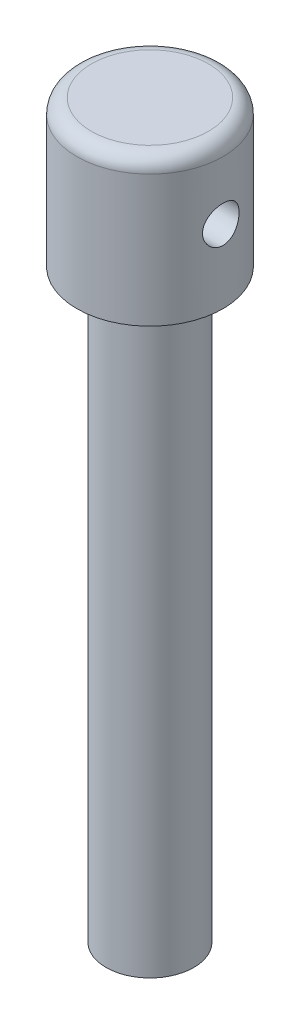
from build123d import *

# Parameters (mm, degrees)
SKETCH1_R               = 6
BOSS_EXTRUDE1_DEPTH     = 40
SKETCH2_R               = 10
BOSS_EXTRUDE2_DEPTH     = 20
CUT_EXTRUDE1_DEPTH      = 135.744202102
CUT_EXTRUDE1_DEPTH_BACK = 135.744202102
SKETCH3_R               = 2.5
FILLET1_R               = 2


with BuildPart() as part:
    # Sketch1 → Boss-Extrude1 (new, symmetric)
    with BuildSketch(Plane(origin=(0, 74, 0), x_dir=(1, 0, 0), z_dir=(0, 1, 0))):
        with Locations(Location((0, 0, 0), (0, 0, 270))):
            Circle(SKETCH1_R)
    extrude(amount=BOSS_EXTRUDE1_DEPTH, both=True)

    # Sketch2 → Boss-Extrude2 (add)
    with BuildSketch(Plane(origin=(0, 114, 0), x_dir=(1, 0, 0), z_dir=(0, 1, 0))):
        with Locations(Location((0, 0, 0), (0, 0, 270))):
            Circle(SKETCH2_R)
    extrude(amount=BOSS_EXTRUDE2_DEPTH)

    # Sketch3 → Cut-Extrude1 (cut, two sides: drawn at the far end of the back side and taken through both)
    with BuildSketch(Plane(origin=(0, 0, 0), x_dir=(0, 0, -1), z_dir=(1, 0, 0)).offset(-CUT_EXTRUDE1_DEPTH_BACK)):
        with Locations((0, 124)):
            Circle(SKETCH3_R)
    extrude(amount=CUT_EXTRUDE1_DEPTH + CUT_EXTRUDE1_DEPTH_BACK, mode=Mode.SUBTRACT)

    # Fillet1
    fillet1_edges = [part.edges().sort_by_distance(p)[0] for p in [
        (0, 134, -10),
    ]]
    fillet(fillet1_edges, radius=FILLET1_R)


solid = part.part
